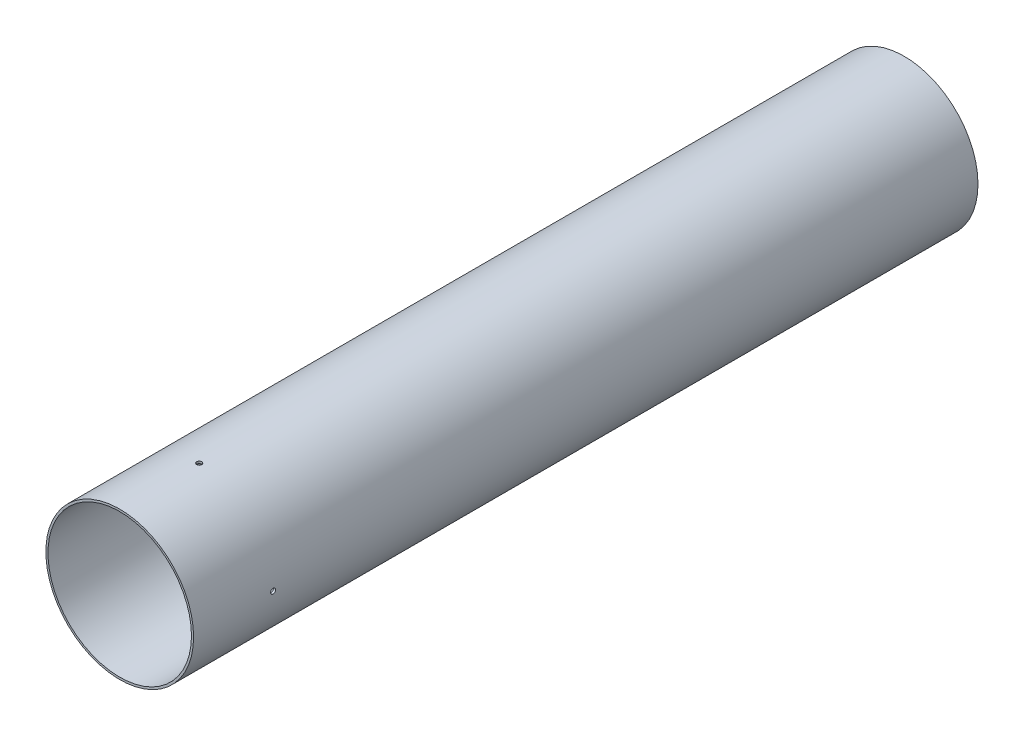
from build123d import *

# Parameters (mm, degrees)
SKETCH1_R               = 70.0786
SKETCH1_R_2             = 68.072
BOSS_EXTRUDE1_DEPTH     = 744.22
CUT_EXTRUDE1_DEPTH      = 751.789869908
CUT_EXTRUDE1_DEPTH_BACK = 751.789869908
SKETCH2_R               = 2.4003
CUT_EXTRUDE2_DEPTH      = 751.789870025
CUT_EXTRUDE2_DEPTH_BACK = 751.789870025
SKETCH3_R               = 2.4003


with BuildPart() as part:
    # Sketch1 → Boss-Extrude1 (new body)
    with BuildSketch(Plane.XY):
        Circle(SKETCH1_R)
        Circle(SKETCH1_R_2, mode=Mode.SUBTRACT)
    extrude(amount=BOSS_EXTRUDE1_DEPTH)

    # Sketch2 → Cut-Extrude1 (cut, two sides: drawn at the far end of the back side and taken through both)
    with BuildSketch(Plane(origin=(0, 0, 0), x_dir=(0, 0, -1), z_dir=(1, 0, 0)).offset(-CUT_EXTRUDE1_DEPTH_BACK)):
        with Locations((-668.81502, 0)):
            Circle(SKETCH2_R)
    extrude(amount=CUT_EXTRUDE1_DEPTH + CUT_EXTRUDE1_DEPTH_BACK, mode=Mode.SUBTRACT)

    # Sketch3 → Cut-Extrude2 (cut, two sides: drawn at the far end of the back side and taken through both)
    with BuildSketch(Plane(origin=(0, 0, 0), x_dir=(1, 0, 0), z_dir=(0, 1, 0)).offset(-CUT_EXTRUDE2_DEPTH_BACK)):
        with Locations(Location((0, -668.81502, 0), (0, 0, 270))):
            Circle(SKETCH3_R)
    extrude(amount=CUT_EXTRUDE2_DEPTH + CUT_EXTRUDE2_DEPTH_BACK, mode=Mode.SUBTRACT)


solid = part.part
